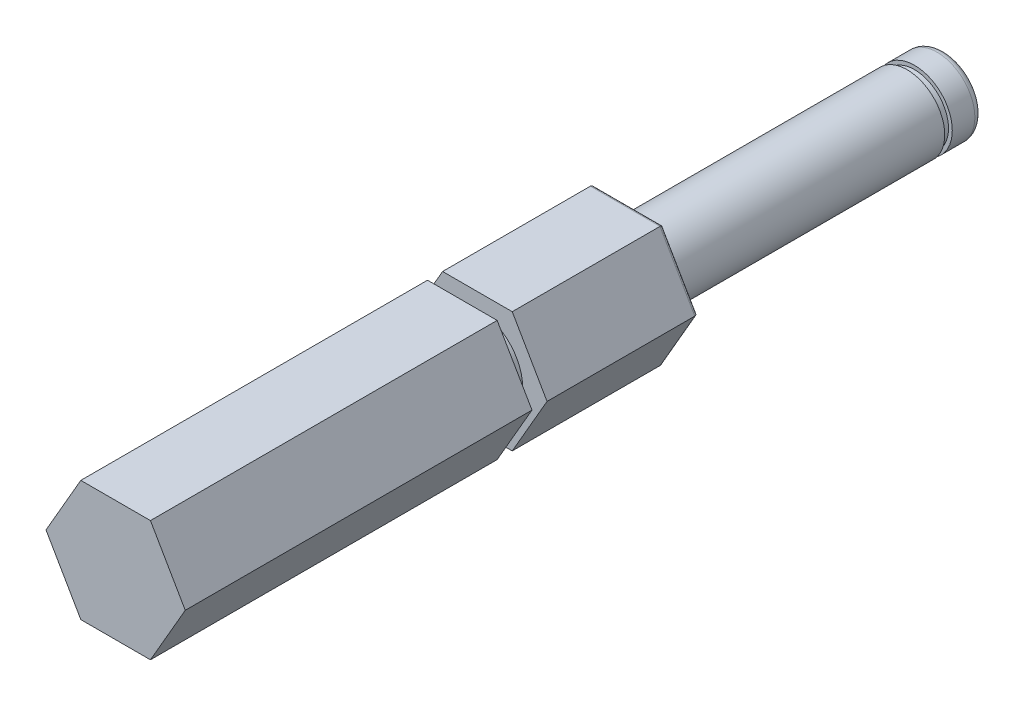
from build123d import *

# Parameters (mm, degrees)
BASE_EXTRUSION_DEPTH = 23
ESQUISSE2_R          = 3
BOSS_EXTRU_1_DEPTH   = 1
BOSS_EXTRU_2_DEPTH   = 10
ESQUISSE4_R          = 2.5
BOSS_EXTRU_3_DEPTH   = 21
CONG_1_R             = 0.2
CONG_2_R             = 0.5
ESQUISSE16_W         = 0.25
ESQUISSE16_H         = 0.5


with BuildPart() as part:
    # Esquisse1 → Base-Extrusion (new body)
    with BuildSketch(Plane.XY):
        Polygon((4.618802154, 0), (2.309401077, 4), (-2.309401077, 4), (-4.618802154, 0), (-2.309401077, -4), (2.309401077, -4), align=None)
    extrude(amount=-BASE_EXTRUSION_DEPTH)

    # Esquisse2 → Boss.-Extru.1 (add)
    with BuildSketch(Plane(origin=(0, 0, -23), x_dir=(-1, 0, 0), z_dir=(0, 0, -1))):
        with Locations(Location((0, 0, 0), (0, 0, 180))):
            Circle(ESQUISSE2_R)
    extrude(amount=BOSS_EXTRU_1_DEPTH)

    # Esquisse3 → Boss.-Extru.2 (add)
    with BuildSketch(Plane(origin=(0, 0, -24), x_dir=(-1, 0, 0), z_dir=(0, 0, -1))):
        Polygon((2.309401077, -4), (-2.309401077, -4), (-4.618802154, 0), (-2.309401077, 4), (2.309401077, 4), (4.618802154, 0), align=None)
    extrude(amount=BOSS_EXTRU_2_DEPTH)

    # Esquisse4 → Boss.-Extru.3 (add)
    with BuildSketch(Plane(origin=(0, 0, -34), x_dir=(-1, 0, 0), z_dir=(0, 0, -1))):
        with Locations(Location((0, 0, 0), (0, 0, 180))):
            Circle(ESQUISSE4_R)
    extrude(amount=BOSS_EXTRU_3_DEPTH)

    # Cong_1
    cong_1_edges = [part.edges().sort_by_distance(p)[0] for p in [
        (0, -4, -34),
        (-3.464101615, -2, -34),
        (3.464101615, -2, -34),
        (-3.464101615, 2, -34),
        (3.464101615, 2, -34),
        (0, 4, -34),
    ]]
    fillet(cong_1_edges, radius=CONG_1_R)

    # Cong_2
    cong_2_edges = [part.edges().sort_by_distance(p)[0] for p in [
        (-2.5, 0, -55),
    ]]
    fillet(cong_2_edges, radius=CONG_2_R)

    # Esquisse16 → Enl_vement de mati_re-R_volution1 (revolve, cut)
    with BuildSketch(Plane(origin=(0, 0, 0), x_dir=(1, 0, 0), z_dir=(0, 1, 0))):
        with Locations((2.375, 52.75)):
            Rectangle(ESQUISSE16_W, ESQUISSE16_H)
    revolve(axis=Axis((0, 0, -39.786734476), (0, 0, -1)), mode=Mode.SUBTRACT)


solid = part.part
